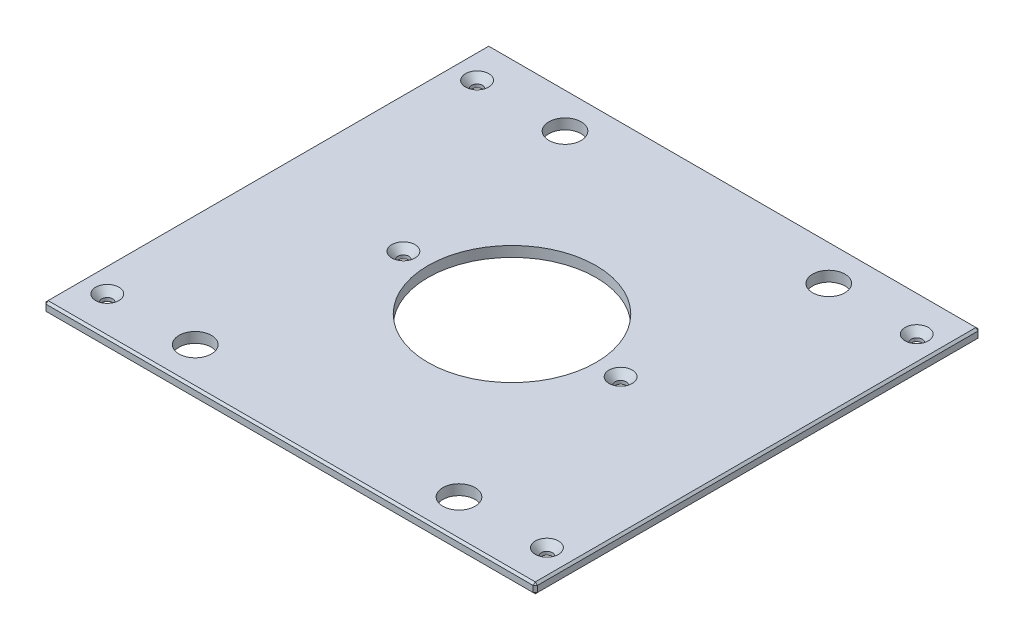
from build123d import *

# Parameters (mm, degrees)
SKETCH1_W                                     = 301.625
SKETCH1_H                                     = 273.05
BOSS_EXTRUDE1_DEPTH                           = 6.35
SKETCH13_R                                    = 51.562
CUT_EXTRUDE6_DEPTH                            = 204.528396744
F_25_32_0_78125_DIAMETER_HOLE1_D              = 19.84375
CHAMFER2_SIZE                                 = 1.27
CSK_FOR_1_4_FLAT_HEAD_MACHINE_SCREW1_AT_COUNT = 2
CSK_FOR_1_4_FLAT_HEAD_MACHINE_SCREW1_AT_PITCH = 227.00996
CSK_FOR_1_4_FLAT_HEAD_MACHINE_SCREW1_2_COUNT  = 2
CSK_FOR_1_4_FLAT_HEAD_MACHINE_SCREW1_2_PITCH  = 352.655692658
CSK_FOR_1_4_FLAT_HEAD_MACHINE_SCREW1_3_COUNT  = 2
CSK_FOR_1_4_FLAT_HEAD_MACHINE_SCREW1_3_PITCH  = 231.367630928
CSK_FOR_1_4_FLAT_HEAD_MACHINE_SCREW1_4_COUNT  = 2
CSK_FOR_1_4_FLAT_HEAD_MACHINE_SCREW1_4_PITCH  = 132.450554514
CSK_FOR_1_4_FLAT_HEAD_MACHINE_SCREW1_5_COUNT  = 2
CSK_FOR_1_4_FLAT_HEAD_MACHINE_SCREW1_5_PITCH  = 269.875
CSK_FOR_1_4_FLAT_HEAD_MACHINE_SCREW1_6_COUNT  = 2
CSK_FOR_1_4_FLAT_HEAD_MACHINE_SCREW1_6_PITCH  = 215.9
CSK_FOR_1_4_FLAT_HEAD_MACHINE_SCREW1_7_COUNT  = 2
CSK_FOR_1_4_FLAT_HEAD_MACHINE_SCREW1_7_PITCH  = 313.283149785


with BuildPart() as part:
    # Sketch1 → Boss-Extrude1 (new body)
    with BuildSketch(Plane(origin=(0, 0, 0), x_dir=(1, 0, 0), z_dir=(0, 1, 0))):
        Rectangle(SKETCH1_W, SKETCH1_H)
    extrude(amount=BOSS_EXTRUDE1_DEPTH)

    # Sketch13 → Cut-Extrude6 (cut, through all)
    with BuildSketch(Plane(origin=(0, 6.35, 0), x_dir=(1, 0, 0), z_dir=(0, 1, 0))):
        with Locations(Location((0, 0, 0), (0, 0, 270))):
            Circle(SKETCH13_R)
    extrude(amount=-CUT_EXTRUDE6_DEPTH, mode=Mode.SUBTRACT)

    # 25_32 _0.78125_ Diameter Hole1 (through all)
    with Locations(Plane(origin=(0, 6.35, 0), x_dir=(1, 0, 0), z_dir=(0, 1, 0))):
        with Locations((80.9625, 113.50498), (-80.9625, 113.50498), (80.9625, -113.50498), (-80.9625, -113.50498)):
            Hole(F_25_32_0_78125_DIAMETER_HOLE1_D / 2)

    # Chamfer2
    chamfer2_edges = [part.edges().sort_by_distance(p)[0] for p in [
        (150.8125, 6.35, 0),
        (0, 6.35, -136.525),
        (-150.8125, 6.35, 0),
        (0, 0, -136.525),
        (150.8125, 0, 0),
        (0, 0, 136.525),
        (-150.8125, 0, 0),
        (0, 6.35, 136.525),
        (-150.8125, 3.175, -136.525),
        (150.8125, 3.175, -136.525),
        (150.8125, 3.175, 136.525),
        (-150.8125, 3.175, 136.525),
    ]]
    chamfer(chamfer2_edges, length=CHAMFER2_SIZE)

    # Sketch24 → CSK for 1_4 Flat Head Machine Screw1 (revolve, cut)
    with BuildSketch(Plane(origin=(134.9375, 6.35, -113.50498), x_dir=(0, 0, 1), z_dir=(1, 0, 0))):
        Polygon((0, 0), (0, 6.35), (3.3782, 6.35), (3.3782, 4.324464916), (7.1374, 0), align=None)
    csk_for_1_4_flat_head_machine_screw1 = revolve(axis=Axis((134.9375, 12.7, -113.50498), (0, -1, 0)), mode=Mode.SUBTRACT)

    # CSK for 1_4 Flat Head Machine Screw1 at: CSK for 1_4 Flat Head Machine Screw1 ×2
    with Locations(*[(0, 0, i * CSK_FOR_1_4_FLAT_HEAD_MACHINE_SCREW1_AT_PITCH) for i in range(1, CSK_FOR_1_4_FLAT_HEAD_MACHINE_SCREW1_AT_COUNT)]):
        add(csk_for_1_4_flat_head_machine_screw1, mode=Mode.SUBTRACT)

    # CSK for 1_4 Flat Head Machine Screw1 2: CSK for 1_4 Flat Head Machine Screw1 ×2
    with Locations(*[Vector(-0.7652648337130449, 0, 0.6437155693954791) * (i * CSK_FOR_1_4_FLAT_HEAD_MACHINE_SCREW1_2_PITCH) for i in range(1, CSK_FOR_1_4_FLAT_HEAD_MACHINE_SCREW1_2_COUNT)]):
        add(csk_for_1_4_flat_head_machine_screw1, mode=Mode.SUBTRACT)

    # CSK for 1_4 Flat Head Machine Screw1 3: CSK for 1_4 Flat Head Machine Screw1 ×2
    with Locations(*[Vector(-0.8713945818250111, 0, 0.4905827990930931) * (i * CSK_FOR_1_4_FLAT_HEAD_MACHINE_SCREW1_3_PITCH) for i in range(1, CSK_FOR_1_4_FLAT_HEAD_MACHINE_SCREW1_3_COUNT)]):
        add(csk_for_1_4_flat_head_machine_screw1, mode=Mode.SUBTRACT)

    # CSK for 1_4 Flat Head Machine Screw1 4: CSK for 1_4 Flat Head Machine Screw1 ×2
    with Locations(*[Vector(-0.5153810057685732, 0, 0.8569611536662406) * (i * CSK_FOR_1_4_FLAT_HEAD_MACHINE_SCREW1_4_PITCH) for i in range(1, CSK_FOR_1_4_FLAT_HEAD_MACHINE_SCREW1_4_COUNT)]):
        add(csk_for_1_4_flat_head_machine_screw1, mode=Mode.SUBTRACT)

    # CSK for 1_4 Flat Head Machine Screw1 5: CSK for 1_4 Flat Head Machine Screw1 ×2
    with Locations(*[(-i * CSK_FOR_1_4_FLAT_HEAD_MACHINE_SCREW1_5_PITCH, 0, 0) for i in range(1, CSK_FOR_1_4_FLAT_HEAD_MACHINE_SCREW1_5_COUNT)]):
        add(csk_for_1_4_flat_head_machine_screw1, mode=Mode.SUBTRACT)

    # CSK for 1_4 Flat Head Machine Screw1 6: CSK for 1_4 Flat Head Machine Screw1 ×2
    with Locations(*[(-i * CSK_FOR_1_4_FLAT_HEAD_MACHINE_SCREW1_6_PITCH, 0, 0) for i in range(1, CSK_FOR_1_4_FLAT_HEAD_MACHINE_SCREW1_6_COUNT)]):
        add(csk_for_1_4_flat_head_machine_screw1, mode=Mode.SUBTRACT)

    # CSK for 1_4 Flat Head Machine Screw1 7: CSK for 1_4 Flat Head Machine Screw1 ×2
    with Locations(*[Vector(-0.6891529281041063, 0, 0.7246159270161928) * (i * CSK_FOR_1_4_FLAT_HEAD_MACHINE_SCREW1_7_PITCH) for i in range(1, CSK_FOR_1_4_FLAT_HEAD_MACHINE_SCREW1_7_COUNT)]):
        add(csk_for_1_4_flat_head_machine_screw1, mode=Mode.SUBTRACT)


solid = part.part
